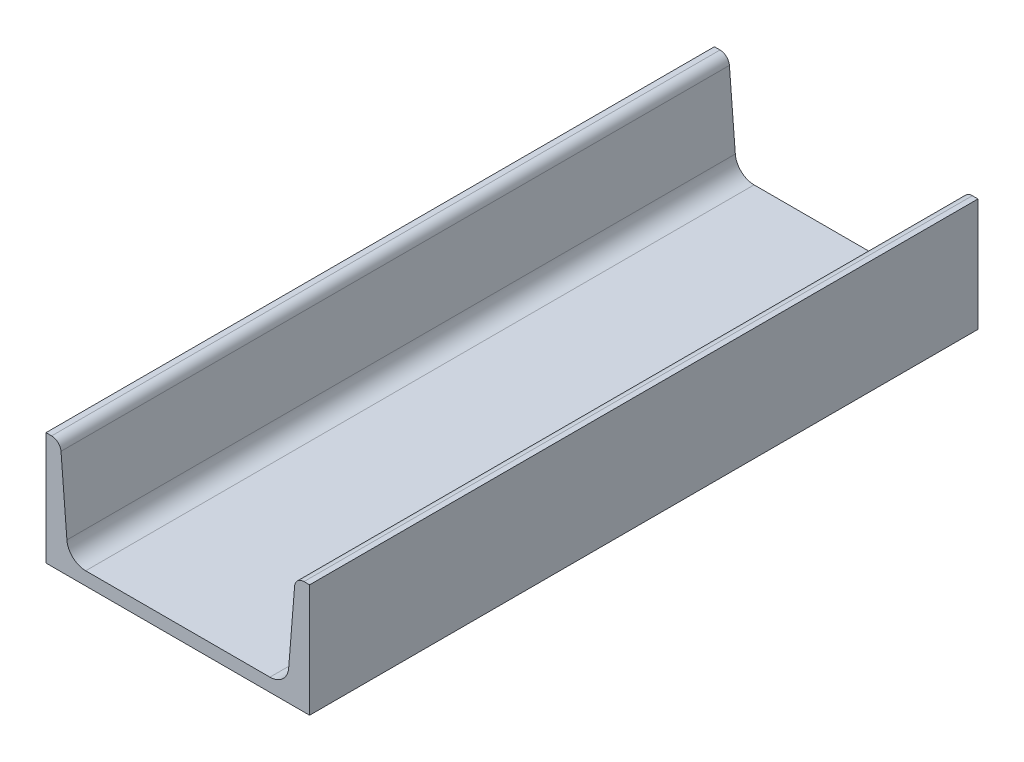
ISO-10303-21;
HEADER;
FILE_DESCRIPTION(('STEP AP214'),'2;1');
FILE_NAME('part.step','',(''),(''),'','','');
FILE_SCHEMA(('AUTOMOTIVE_DESIGN { 1 0 10303 214 1 1 1 1 }'));
ENDSEC;
DATA;
#1=APPLICATION_CONTEXT('core data for automotive mechanical design processes');
#2=APPLICATION_PROTOCOL_DEFINITION('international standard','automotive_design',2000,#1);
#3=PRODUCT_CONTEXT('',#1,'mechanical');
#4=PRODUCT('Part','Part','',(#3));
#5=PRODUCT_RELATED_PRODUCT_CATEGORY('part','',(#4));
#6=PRODUCT_DEFINITION_FORMATION('','',#4);
#7=PRODUCT_DEFINITION_CONTEXT('part definition',#1,'design');
#8=PRODUCT_DEFINITION('design','',#6,#7);
#9=PRODUCT_DEFINITION_SHAPE('','',#8);
#10=(LENGTH_UNIT() NAMED_UNIT(*) SI_UNIT(.MILLI.,.METRE.));
#11=(NAMED_UNIT(*) PLANE_ANGLE_UNIT() SI_UNIT($,.RADIAN.));
#12=(NAMED_UNIT(*) SI_UNIT($,.STERADIAN.) SOLID_ANGLE_UNIT());
#13=UNCERTAINTY_MEASURE_WITH_UNIT(LENGTH_MEASURE(1.E-05),#10,'distance_accuracy_value','');
#14=(GEOMETRIC_REPRESENTATION_CONTEXT(3) GLOBAL_UNCERTAINTY_ASSIGNED_CONTEXT((#13)) GLOBAL_UNIT_ASSIGNED_CONTEXT((#10,
#11,#12)) REPRESENTATION_CONTEXT('',''));
#15=CARTESIAN_POINT('',(0.,0.,0.));
#16=DIRECTION('',(0.,0.,1.));
#17=DIRECTION('',(1.,0.,0.));
#18=AXIS2_PLACEMENT_3D('',#15,#16,#17);
#19=CARTESIAN_POINT('',(48.9280510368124,17.,177.5));
#20=DIRECTION('',(0.,0.,-1.));
#21=DIRECTION('',(-1.,0.,0.));
#22=AXIS2_PLACEMENT_3D('',#19,#20,#21);
#23=CYLINDRICAL_SURFACE('',#22,10.);
#24=CARTESIAN_POINT('',(48.9280510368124,17.,-177.5));
#25=DIRECTION('',(0.,0.,1.));
#26=DIRECTION('',(1.,0.,0.));
#27=AXIS2_PLACEMENT_3D('',#24,#25,#26);
#28=CIRCLE('',#27,10.);
#29=CARTESIAN_POINT('',(48.9280510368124,7.,-177.5));
#30=VERTEX_POINT('',#29);
#31=CARTESIAN_POINT('',(58.8962038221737,16.202547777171,-177.5));
#32=VERTEX_POINT('',#31);
#33=EDGE_CURVE('E103',#30,#32,#28,.T.);
#34=ORIENTED_EDGE('',*,*,#33,.F.);
#35=DIRECTION('',(0.,0.,-1.));
#36=VECTOR('',#35,1.);
#37=CARTESIAN_POINT('',(48.9280510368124,7.,177.5));
#38=LINE('',#37,#36);
#39=CARTESIAN_POINT('',(48.9280510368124,7.,177.5));
#40=VERTEX_POINT('',#39);
#41=EDGE_CURVE('E9',#40,#30,#38,.T.);
#42=ORIENTED_EDGE('',*,*,#41,.F.);
#43=CARTESIAN_POINT('',(48.9280510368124,17.,177.5));
#44=DIRECTION('',(0.,0.,1.));
#45=DIRECTION('',(1.,0.,0.));
#46=AXIS2_PLACEMENT_3D('',#43,#44,#45);
#47=CIRCLE('',#46,10.);
#48=CARTESIAN_POINT('',(58.8962038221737,16.202547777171,177.5));
#49=VERTEX_POINT('',#48);
#50=EDGE_CURVE('E105',#40,#49,#47,.T.);
#51=ORIENTED_EDGE('',*,*,#50,.T.);
#52=DIRECTION('',(0.,0.,-1.));
#53=VECTOR('',#52,1.);
#54=CARTESIAN_POINT('',(58.8962038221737,16.202547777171,177.5));
#55=LINE('',#54,#53);
#56=EDGE_CURVE('E17',#49,#32,#55,.T.);
#57=ORIENTED_EDGE('',*,*,#56,.T.);
#58=EDGE_LOOP('',(#34,#42,#51,#57));
#59=FACE_BOUND('',#58,.T.);
#60=ADVANCED_FACE('F14',(#59),#23,.F.);
#61=CARTESIAN_POINT('',(-48.9280510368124,7.,177.5));
#62=DIRECTION('',(0.,1.,0.));
#63=DIRECTION('',(0.,0.,1.));
#64=AXIS2_PLACEMENT_3D('',#61,#62,#63);
#65=PLANE('',#64);
#66=DIRECTION('',(1.,0.,0.));
#67=VECTOR('',#66,1.);
#68=CARTESIAN_POINT('',(-48.9280510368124,7.,-177.5));
#69=LINE('',#68,#67);
#70=CARTESIAN_POINT('',(-48.9280510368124,7.,-177.5));
#71=VERTEX_POINT('',#70);
#72=EDGE_CURVE('E124',#71,#30,#69,.T.);
#73=ORIENTED_EDGE('',*,*,#72,.F.);
#74=DIRECTION('',(0.,0.,-1.));
#75=VECTOR('',#74,1.);
#76=CARTESIAN_POINT('',(-48.9280510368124,7.,177.5));
#77=LINE('',#76,#75);
#78=CARTESIAN_POINT('',(-48.9280510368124,7.,177.5));
#79=VERTEX_POINT('',#78);
#80=EDGE_CURVE('E23',#79,#71,#77,.T.);
#81=ORIENTED_EDGE('',*,*,#80,.F.);
#82=DIRECTION('',(1.,0.,0.));
#83=VECTOR('',#82,1.);
#84=CARTESIAN_POINT('',(-48.9280510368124,7.,177.5));
#85=LINE('',#84,#83);
#86=EDGE_CURVE('E111',#79,#40,#85,.T.);
#87=ORIENTED_EDGE('',*,*,#86,.T.);
#88=ORIENTED_EDGE('',*,*,#41,.T.);
#89=EDGE_LOOP('',(#73,#81,#87,#88));
#90=FACE_BOUND('',#89,.T.);
#91=ADVANCED_FACE('F315',(#90),#65,.T.);
#92=CARTESIAN_POINT('',(-48.9280510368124,17.,177.5));
#93=DIRECTION('',(0.,0.,-1.));
#94=DIRECTION('',(-1.,0.,0.));
#95=AXIS2_PLACEMENT_3D('',#92,#93,#94);
#96=CYLINDRICAL_SURFACE('',#95,10.);
#97=CARTESIAN_POINT('',(-48.9280510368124,17.,-177.5));
#98=DIRECTION('',(0.,0.,1.));
#99=DIRECTION('',(1.,0.,0.));
#100=AXIS2_PLACEMENT_3D('',#97,#98,#99);
#101=CIRCLE('',#100,10.);
#102=CARTESIAN_POINT('',(-58.8962038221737,16.2025477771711,-177.5));
#103=VERTEX_POINT('',#102);
#104=EDGE_CURVE('E337',#103,#71,#101,.T.);
#105=ORIENTED_EDGE('',*,*,#104,.F.);
#106=DIRECTION('',(0.,0.,-1.));
#107=VECTOR('',#106,1.);
#108=CARTESIAN_POINT('',(-58.8962038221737,16.2025477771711,177.5));
#109=LINE('',#108,#107);
#110=CARTESIAN_POINT('',(-58.8962038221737,16.2025477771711,177.5));
#111=VERTEX_POINT('',#110);
#112=EDGE_CURVE('E170',#111,#103,#109,.T.);
#113=ORIENTED_EDGE('',*,*,#112,.F.);
#114=CARTESIAN_POINT('',(-48.9280510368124,17.,177.5));
#115=DIRECTION('',(0.,0.,1.));
#116=DIRECTION('',(1.,0.,0.));
#117=AXIS2_PLACEMENT_3D('',#114,#115,#116);
#118=CIRCLE('',#117,10.);
#119=EDGE_CURVE('E161',#111,#79,#118,.T.);
#120=ORIENTED_EDGE('',*,*,#119,.T.);
#121=ORIENTED_EDGE('',*,*,#80,.T.);
#122=EDGE_LOOP('',(#105,#113,#120,#121));
#123=FACE_BOUND('',#122,.T.);
#124=ADVANCED_FACE('F306',(#123),#96,.F.);
#125=CARTESIAN_POINT('',(-58.8962038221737,16.2025477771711,177.5));
#126=DIRECTION('',(-0.996815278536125,-0.07974522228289,0.));
#127=DIRECTION('',(0.07974522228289,-0.996815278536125,0.));
#128=AXIS2_PLACEMENT_3D('',#125,#126,#127);
#129=PLANE('',#128);
#130=DIRECTION('',(-0.07974522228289,0.996815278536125,0.));
#131=VECTOR('',#130,1.);
#132=CARTESIAN_POINT('',(-58.8962038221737,16.2025477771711,-177.5));
#133=LINE('',#132,#131);
#134=CARTESIAN_POINT('',(-62.0318980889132,55.3987261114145,-177.5));
#135=VERTEX_POINT('',#134);
#136=EDGE_CURVE('E343',#103,#135,#133,.T.);
#137=ORIENTED_EDGE('',*,*,#136,.T.);
#138=DIRECTION('',(0.,0.,-1.));
#139=VECTOR('',#138,1.);
#140=CARTESIAN_POINT('',(-62.0318980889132,55.3987261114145,177.5));
#141=LINE('',#140,#139);
#142=CARTESIAN_POINT('',(-62.0318980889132,55.3987261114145,177.5));
#143=VERTEX_POINT('',#142);
#144=EDGE_CURVE('E173',#143,#135,#141,.T.);
#145=ORIENTED_EDGE('',*,*,#144,.F.);
#146=DIRECTION('',(-0.07974522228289,0.996815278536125,0.));
#147=VECTOR('',#146,1.);
#148=CARTESIAN_POINT('',(-58.8962038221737,16.2025477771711,177.5));
#149=LINE('',#148,#147);
#150=EDGE_CURVE('E158',#111,#143,#149,.T.);
#151=ORIENTED_EDGE('',*,*,#150,.F.);
#152=ORIENTED_EDGE('',*,*,#112,.T.);
#153=EDGE_LOOP('',(#137,#145,#151,#152));
#154=FACE_BOUND('',#153,.T.);
#155=ADVANCED_FACE('F297',(#154),#129,.F.);
#156=CARTESIAN_POINT('',(-67.0159744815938,55.,177.5));
#157=DIRECTION('',(0.,0.,-1.));
#158=DIRECTION('',(-1.,0.,0.));
#159=AXIS2_PLACEMENT_3D('',#156,#157,#158);
#160=CYLINDRICAL_SURFACE('',#159,5.);
#161=CARTESIAN_POINT('',(-67.0159744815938,55.,-177.5));
#162=DIRECTION('',(0.,0.,1.));
#163=DIRECTION('',(1.,0.,0.));
#164=AXIS2_PLACEMENT_3D('',#161,#162,#163);
#165=CIRCLE('',#164,5.);
#166=CARTESIAN_POINT('',(-67.0159744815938,60.,-177.5));
#167=VERTEX_POINT('',#166);
#168=EDGE_CURVE('E349',#135,#167,#165,.T.);
#169=ORIENTED_EDGE('',*,*,#168,.T.);
#170=DIRECTION('',(0.,0.,-1.));
#171=VECTOR('',#170,1.);
#172=CARTESIAN_POINT('',(-67.0159744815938,60.,177.5));
#173=LINE('',#172,#171);
#174=CARTESIAN_POINT('',(-67.0159744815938,60.,177.5));
#175=VERTEX_POINT('',#174);
#176=EDGE_CURVE('E177',#175,#167,#173,.T.);
#177=ORIENTED_EDGE('',*,*,#176,.F.);
#178=CARTESIAN_POINT('',(-67.0159744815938,55.,177.5));
#179=DIRECTION('',(0.,0.,1.));
#180=DIRECTION('',(1.,0.,0.));
#181=AXIS2_PLACEMENT_3D('',#178,#179,#180);
#182=CIRCLE('',#181,5.);
#183=EDGE_CURVE('E155',#143,#175,#182,.T.);
#184=ORIENTED_EDGE('',*,*,#183,.F.);
#185=ORIENTED_EDGE('',*,*,#144,.T.);
#186=EDGE_LOOP('',(#169,#177,#184,#185));
#187=FACE_BOUND('',#186,.T.);
#188=ADVANCED_FACE('F288',(#187),#160,.T.);
#189=CARTESIAN_POINT('',(-70.,60.,177.5));
#190=DIRECTION('',(0.,1.,0.));
#191=DIRECTION('',(0.,0.,1.));
#192=AXIS2_PLACEMENT_3D('',#189,#190,#191);
#193=PLANE('',#192);
#194=DIRECTION('',(1.,0.,0.));
#195=VECTOR('',#194,1.);
#196=CARTESIAN_POINT('',(-70.,60.,-177.5));
#197=LINE('',#196,#195);
#198=CARTESIAN_POINT('',(-70.,60.,-177.5));
#199=VERTEX_POINT('',#198);
#200=EDGE_CURVE('E357',#199,#167,#197,.T.);
#201=ORIENTED_EDGE('',*,*,#200,.F.);
#202=DIRECTION('',(0.,0.,-1.));
#203=VECTOR('',#202,1.);
#204=CARTESIAN_POINT('',(-70.,60.,177.5));
#205=LINE('',#204,#203);
#206=CARTESIAN_POINT('',(-70.,60.,177.5));
#207=VERTEX_POINT('',#206);
#208=EDGE_CURVE('E180',#207,#199,#205,.T.);
#209=ORIENTED_EDGE('',*,*,#208,.F.);
#210=DIRECTION('',(1.,0.,0.));
#211=VECTOR('',#210,1.);
#212=CARTESIAN_POINT('',(-70.,60.,177.5));
#213=LINE('',#212,#211);
#214=EDGE_CURVE('E151',#207,#175,#213,.T.);
#215=ORIENTED_EDGE('',*,*,#214,.T.);
#216=ORIENTED_EDGE('',*,*,#176,.T.);
#217=EDGE_LOOP('',(#201,#209,#215,#216));
#218=FACE_BOUND('',#217,.T.);
#219=ADVANCED_FACE('F279',(#218),#193,.T.);
#220=CARTESIAN_POINT('',(-70.,60.,177.5));
#221=DIRECTION('',(1.,0.,0.));
#222=DIRECTION('',(0.,0.,-1.));
#223=AXIS2_PLACEMENT_3D('',#220,#221,#222);
#224=PLANE('',#223);
#225=DIRECTION('',(0.,-1.,0.));
#226=VECTOR('',#225,1.);
#227=CARTESIAN_POINT('',(-70.,60.,-177.5));
#228=LINE('',#227,#226);
#229=CARTESIAN_POINT('',(-70.,0.,-177.5));
#230=VERTEX_POINT('',#229);
#231=EDGE_CURVE('E365',#199,#230,#228,.T.);
#232=ORIENTED_EDGE('',*,*,#231,.T.);
#233=DIRECTION('',(0.,0.,-1.));
#234=VECTOR('',#233,1.);
#235=CARTESIAN_POINT('',(-70.,0.,177.5));
#236=LINE('',#235,#234);
#237=CARTESIAN_POINT('',(-70.,0.,177.5));
#238=VERTEX_POINT('',#237);
#239=EDGE_CURVE('E183',#238,#230,#236,.T.);
#240=ORIENTED_EDGE('',*,*,#239,.F.);
#241=DIRECTION('',(0.,-1.,0.));
#242=VECTOR('',#241,1.);
#243=CARTESIAN_POINT('',(-70.,60.,177.5));
#244=LINE('',#243,#242);
#245=EDGE_CURVE('E148',#207,#238,#244,.T.);
#246=ORIENTED_EDGE('',*,*,#245,.F.);
#247=ORIENTED_EDGE('',*,*,#208,.T.);
#248=EDGE_LOOP('',(#232,#240,#246,#247));
#249=FACE_BOUND('',#248,.T.);
#250=ADVANCED_FACE('F270',(#249),#224,.F.);
#251=CARTESIAN_POINT('',(-70.,0.,177.5));
#252=DIRECTION('',(0.,1.,0.));
#253=DIRECTION('',(0.,0.,1.));
#254=AXIS2_PLACEMENT_3D('',#251,#252,#253);
#255=PLANE('',#254);
#256=DIRECTION('',(1.,0.,0.));
#257=VECTOR('',#256,1.);
#258=CARTESIAN_POINT('',(-70.,0.,-177.5));
#259=LINE('',#258,#257);
#260=CARTESIAN_POINT('',(70.,0.,-177.5));
#261=VERTEX_POINT('',#260);
#262=EDGE_CURVE('E372',#230,#261,#259,.T.);
#263=ORIENTED_EDGE('',*,*,#262,.T.);
#264=DIRECTION('',(0.,0.,-1.));
#265=VECTOR('',#264,1.);
#266=CARTESIAN_POINT('',(70.,0.,177.5));
#267=LINE('',#266,#265);
#268=CARTESIAN_POINT('',(70.,0.,177.5));
#269=VERTEX_POINT('',#268);
#270=EDGE_CURVE('E187',#269,#261,#267,.T.);
#271=ORIENTED_EDGE('',*,*,#270,.F.);
#272=DIRECTION('',(1.,0.,0.));
#273=VECTOR('',#272,1.);
#274=CARTESIAN_POINT('',(-70.,0.,177.5));
#275=LINE('',#274,#273);
#276=EDGE_CURVE('E145',#238,#269,#275,.T.);
#277=ORIENTED_EDGE('',*,*,#276,.F.);
#278=ORIENTED_EDGE('',*,*,#239,.T.);
#279=EDGE_LOOP('',(#263,#271,#277,#278));
#280=FACE_BOUND('',#279,.T.);
#281=ADVANCED_FACE('F261',(#280),#255,.F.);
#282=CARTESIAN_POINT('',(70.,0.,177.5));
#283=DIRECTION('',(-1.,0.,0.));
#284=DIRECTION('',(0.,0.,1.));
#285=AXIS2_PLACEMENT_3D('',#282,#283,#284);
#286=PLANE('',#285);
#287=DIRECTION('',(0.,1.,0.));
#288=VECTOR('',#287,1.);
#289=CARTESIAN_POINT('',(70.,0.,-177.5));
#290=LINE('',#289,#288);
#291=CARTESIAN_POINT('',(70.,60.,-177.5));
#292=VERTEX_POINT('',#291);
#293=EDGE_CURVE('E379',#261,#292,#290,.T.);
#294=ORIENTED_EDGE('',*,*,#293,.T.);
#295=DIRECTION('',(0.,0.,-1.));
#296=VECTOR('',#295,1.);
#297=CARTESIAN_POINT('',(70.,60.,177.5));
#298=LINE('',#297,#296);
#299=CARTESIAN_POINT('',(70.,60.,177.5));
#300=VERTEX_POINT('',#299);
#301=EDGE_CURVE('E191',#300,#292,#298,.T.);
#302=ORIENTED_EDGE('',*,*,#301,.F.);
#303=DIRECTION('',(0.,1.,0.));
#304=VECTOR('',#303,1.);
#305=CARTESIAN_POINT('',(70.,0.,177.5));
#306=LINE('',#305,#304);
#307=EDGE_CURVE('E142',#269,#300,#306,.T.);
#308=ORIENTED_EDGE('',*,*,#307,.F.);
#309=ORIENTED_EDGE('',*,*,#270,.T.);
#310=EDGE_LOOP('',(#294,#302,#308,#309));
#311=FACE_BOUND('',#310,.T.);
#312=ADVANCED_FACE('F252',(#311),#286,.F.);
#313=CARTESIAN_POINT('',(70.,60.,177.5));
#314=DIRECTION('',(0.,-1.,0.));
#315=DIRECTION('',(0.,0.,-1.));
#316=AXIS2_PLACEMENT_3D('',#313,#314,#315);
#317=PLANE('',#316);
#318=DIRECTION('',(-1.,0.,0.));
#319=VECTOR('',#318,1.);
#320=CARTESIAN_POINT('',(70.,60.,-177.5));
#321=LINE('',#320,#319);
#322=CARTESIAN_POINT('',(67.0159744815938,60.,-177.5));
#323=VERTEX_POINT('',#322);
#324=EDGE_CURVE('E386',#292,#323,#321,.T.);
#325=ORIENTED_EDGE('',*,*,#324,.T.);
#326=DIRECTION('',(0.,0.,-1.));
#327=VECTOR('',#326,1.);
#328=CARTESIAN_POINT('',(67.0159744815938,60.,177.5));
#329=LINE('',#328,#327);
#330=CARTESIAN_POINT('',(67.0159744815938,60.,177.5));
#331=VERTEX_POINT('',#330);
#332=EDGE_CURVE('E195',#331,#323,#329,.T.);
#333=ORIENTED_EDGE('',*,*,#332,.F.);
#334=DIRECTION('',(-1.,0.,0.));
#335=VECTOR('',#334,1.);
#336=CARTESIAN_POINT('',(70.,60.,177.5));
#337=LINE('',#336,#335);
#338=EDGE_CURVE('E139',#300,#331,#337,.T.);
#339=ORIENTED_EDGE('',*,*,#338,.F.);
#340=ORIENTED_EDGE('',*,*,#301,.T.);
#341=EDGE_LOOP('',(#325,#333,#339,#340));
#342=FACE_BOUND('',#341,.T.);
#343=ADVANCED_FACE('F244',(#342),#317,.F.);
#344=CARTESIAN_POINT('',(67.0159744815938,55.,177.5));
#345=DIRECTION('',(0.,0.,-1.));
#346=DIRECTION('',(-1.,0.,0.));
#347=AXIS2_PLACEMENT_3D('',#344,#345,#346);
#348=CYLINDRICAL_SURFACE('',#347,5.);
#349=CARTESIAN_POINT('',(67.0159744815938,55.,-177.5));
#350=DIRECTION('',(0.,0.,1.));
#351=DIRECTION('',(1.,0.,0.));
#352=AXIS2_PLACEMENT_3D('',#349,#350,#351);
#353=CIRCLE('',#352,5.);
#354=CARTESIAN_POINT('',(62.0318980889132,55.3987261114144,-177.5));
#355=VERTEX_POINT('',#354);
#356=EDGE_CURVE('E120',#323,#355,#353,.T.);
#357=ORIENTED_EDGE('',*,*,#356,.T.);
#358=DIRECTION('',(0.,0.,-1.));
#359=VECTOR('',#358,1.);
#360=CARTESIAN_POINT('',(62.0318980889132,55.3987261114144,177.5));
#361=LINE('',#360,#359);
#362=CARTESIAN_POINT('',(62.0318980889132,55.3987261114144,177.5));
#363=VERTEX_POINT('',#362);
#364=EDGE_CURVE('E110',#363,#355,#361,.T.);
#365=ORIENTED_EDGE('',*,*,#364,.F.);
#366=CARTESIAN_POINT('',(67.0159744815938,55.,177.5));
#367=DIRECTION('',(0.,0.,1.));
#368=DIRECTION('',(1.,0.,0.));
#369=AXIS2_PLACEMENT_3D('',#366,#367,#368);
#370=CIRCLE('',#369,5.);
#371=EDGE_CURVE('E136',#331,#363,#370,.T.);
#372=ORIENTED_EDGE('',*,*,#371,.F.);
#373=ORIENTED_EDGE('',*,*,#332,.T.);
#374=EDGE_LOOP('',(#357,#365,#372,#373));
#375=FACE_BOUND('',#374,.T.);
#376=ADVANCED_FACE('F211',(#375),#348,.T.);
#377=CARTESIAN_POINT('',(58.8962038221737,16.202547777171,177.5));
#378=DIRECTION('',(-0.996815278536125,0.0797452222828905,0.));
#379=DIRECTION('',(-0.0797452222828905,-0.996815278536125,0.));
#380=AXIS2_PLACEMENT_3D('',#377,#378,#379);
#381=PLANE('',#380);
#382=DIRECTION('',(0.0797452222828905,0.996815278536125,0.));
#383=VECTOR('',#382,1.);
#384=CARTESIAN_POINT('',(58.8962038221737,16.202547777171,-177.5));
#385=LINE('',#384,#383);
#386=EDGE_CURVE('E113',#32,#355,#385,.T.);
#387=ORIENTED_EDGE('',*,*,#386,.F.);
#388=ORIENTED_EDGE('',*,*,#56,.F.);
#389=DIRECTION('',(0.0797452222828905,0.996815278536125,0.));
#390=VECTOR('',#389,1.);
#391=CARTESIAN_POINT('',(58.8962038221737,16.202547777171,177.5));
#392=LINE('',#391,#390);
#393=EDGE_CURVE('E133',#49,#363,#392,.T.);
#394=ORIENTED_EDGE('',*,*,#393,.T.);
#395=ORIENTED_EDGE('',*,*,#364,.T.);
#396=EDGE_LOOP('',(#387,#388,#394,#395));
#397=FACE_BOUND('',#396,.T.);
#398=ADVANCED_FACE('F114',(#397),#381,.T.);
#399=CARTESIAN_POINT('',(48.9280510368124,17.,177.5));
#400=DIRECTION('',(0.,0.,1.));
#401=DIRECTION('',(1.,0.,0.));
#402=AXIS2_PLACEMENT_3D('',#399,#400,#401);
#403=PLANE('',#402);
#404=ORIENTED_EDGE('',*,*,#50,.F.);
#405=ORIENTED_EDGE('',*,*,#86,.F.);
#406=ORIENTED_EDGE('',*,*,#119,.F.);
#407=ORIENTED_EDGE('',*,*,#150,.T.);
#408=ORIENTED_EDGE('',*,*,#183,.T.);
#409=ORIENTED_EDGE('',*,*,#214,.F.);
#410=ORIENTED_EDGE('',*,*,#245,.T.);
#411=ORIENTED_EDGE('',*,*,#276,.T.);
#412=ORIENTED_EDGE('',*,*,#307,.T.);
#413=ORIENTED_EDGE('',*,*,#338,.T.);
#414=ORIENTED_EDGE('',*,*,#371,.T.);
#415=ORIENTED_EDGE('',*,*,#393,.F.);
#416=EDGE_LOOP('',(#404,#405,#406,#407,#408,#409,#410,#411,#412,#413,#414,#415));
#417=FACE_BOUND('',#416,.T.);
#418=ADVANCED_FACE('F210',(#417),#403,.T.);
#419=CARTESIAN_POINT('',(48.9280510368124,17.,-177.5));
#420=DIRECTION('',(0.,0.,1.));
#421=DIRECTION('',(1.,0.,0.));
#422=AXIS2_PLACEMENT_3D('',#419,#420,#421);
#423=PLANE('',#422);
#424=ORIENTED_EDGE('',*,*,#33,.T.);
#425=ORIENTED_EDGE('',*,*,#386,.T.);
#426=ORIENTED_EDGE('',*,*,#356,.F.);
#427=ORIENTED_EDGE('',*,*,#324,.F.);
#428=ORIENTED_EDGE('',*,*,#293,.F.);
#429=ORIENTED_EDGE('',*,*,#262,.F.);
#430=ORIENTED_EDGE('',*,*,#231,.F.);
#431=ORIENTED_EDGE('',*,*,#200,.T.);
#432=ORIENTED_EDGE('',*,*,#168,.F.);
#433=ORIENTED_EDGE('',*,*,#136,.F.);
#434=ORIENTED_EDGE('',*,*,#104,.T.);
#435=ORIENTED_EDGE('',*,*,#72,.T.);
#436=EDGE_LOOP('',(#424,#425,#426,#427,#428,#429,#430,#431,#432,#433,#434,#435));
#437=FACE_BOUND('',#436,.T.);
#438=ADVANCED_FACE('F122',(#437),#423,.F.);
#439=CLOSED_SHELL('',(#60,#91,#124,#155,#188,#219,#250,#281,#312,#343,#376,#398,#418,#438));
#440=MANIFOLD_SOLID_BREP('B1',#439);
#441=ADVANCED_BREP_SHAPE_REPRESENTATION('',(#18,#440),#14);
#442=SHAPE_DEFINITION_REPRESENTATION(#9,#441);
ENDSEC;
END-ISO-10303-21;
